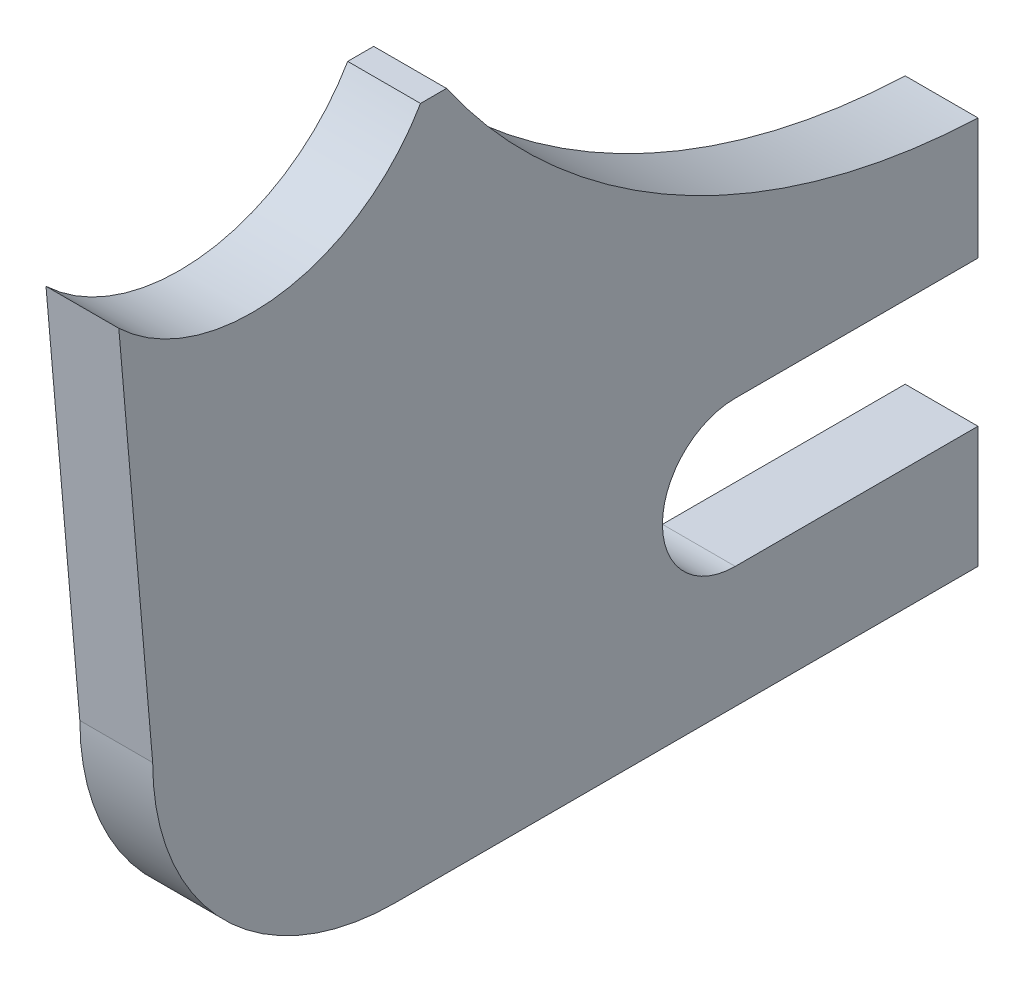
from build123d import *

# Parameters (mm, degrees)
BOSS_EXTRUDE1_DEPTH = 190.5


with BuildPart() as part:
    # Sketch1 → Boss-Extrude1 (new body)
    with BuildSketch(Plane(origin=(0, 0, 0), x_dir=(0, 0, -1), z_dir=(1, 0, 0))):
        with BuildLine():
            Line((-635, 0), (-723.549029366, 1028.073730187))
            ThreePointArc((-723.549029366, 1028.073730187), (-301.117093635, 894.302676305), (65.615883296, 1143))
            Line((65.615883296, 1143), (133.674978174, 1143))
            ThreePointArc((133.674978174, 1143), (739.201641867, 598.452806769), (1524, 381))
            Line((1524, 381), (1524, 63.5))
            Line((1524, 63.5), (889, 63.5))
            ThreePointArc((889, 63.5), (698.5, -127), (889, -317.5))
            Line((889, -317.5), (1524, -317.5))
            Line((1524, -317.5), (1524, -635))
            Line((1524, -635), (0, -635))
            ThreePointArc((0, -635), (-449.012806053, -449.012806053), (-635, 0))
        make_face()
    extrude(amount=BOSS_EXTRUDE1_DEPTH)


solid = part.part
